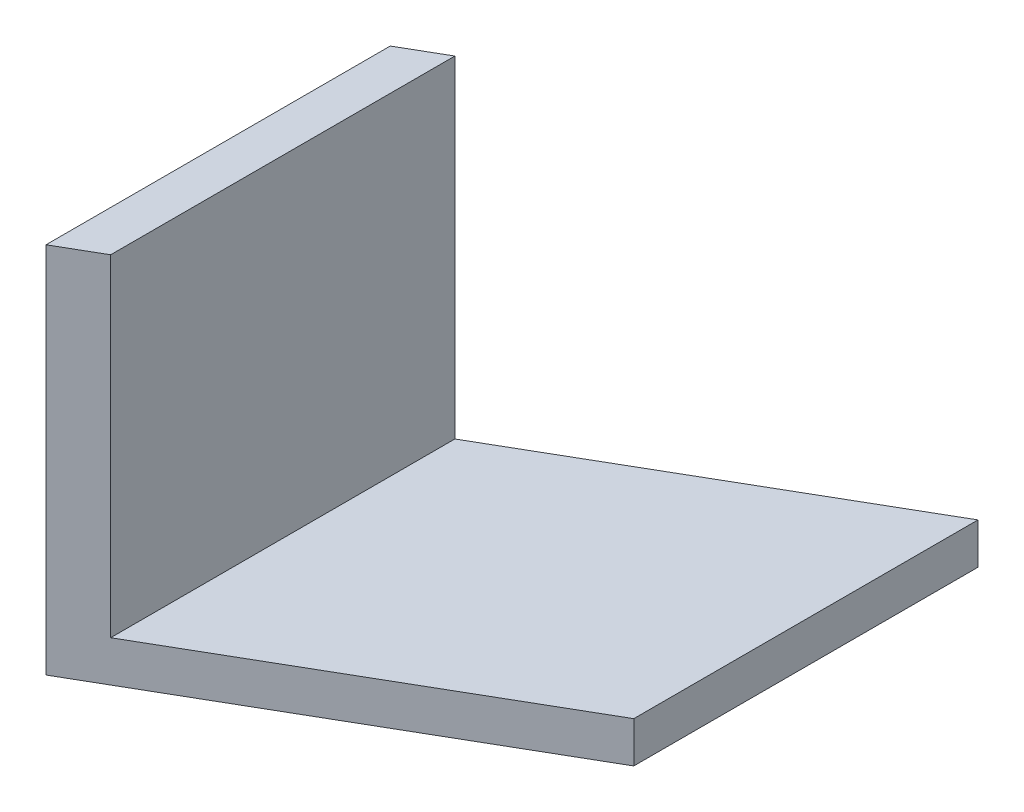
ISO-10303-21;
HEADER;
FILE_DESCRIPTION(('STEP AP214'),'2;1');
FILE_NAME('part.step','',(''),(''),'','','');
FILE_SCHEMA(('AUTOMOTIVE_DESIGN { 1 0 10303 214 1 1 1 1 }'));
ENDSEC;
DATA;
#1=APPLICATION_CONTEXT('core data for automotive mechanical design processes');
#2=APPLICATION_PROTOCOL_DEFINITION('international standard','automotive_design',2000,#1);
#3=PRODUCT_CONTEXT('',#1,'mechanical');
#4=PRODUCT('Part','Part','',(#3));
#5=PRODUCT_RELATED_PRODUCT_CATEGORY('part','',(#4));
#6=PRODUCT_DEFINITION_FORMATION('','',#4);
#7=PRODUCT_DEFINITION_CONTEXT('part definition',#1,'design');
#8=PRODUCT_DEFINITION('design','',#6,#7);
#9=PRODUCT_DEFINITION_SHAPE('','',#8);
#10=(LENGTH_UNIT() NAMED_UNIT(*) SI_UNIT(.MILLI.,.METRE.));
#11=(NAMED_UNIT(*) PLANE_ANGLE_UNIT() SI_UNIT($,.RADIAN.));
#12=(NAMED_UNIT(*) SI_UNIT($,.STERADIAN.) SOLID_ANGLE_UNIT());
#13=UNCERTAINTY_MEASURE_WITH_UNIT(LENGTH_MEASURE(1.E-05),#10,'distance_accuracy_value','');
#14=(GEOMETRIC_REPRESENTATION_CONTEXT(3) GLOBAL_UNCERTAINTY_ASSIGNED_CONTEXT((#13)) GLOBAL_UNIT_ASSIGNED_CONTEXT((#10,
#11,#12)) REPRESENTATION_CONTEXT('',''));
#15=CARTESIAN_POINT('',(0.,0.,0.));
#16=DIRECTION('',(0.,0.,1.));
#17=DIRECTION('',(1.,0.,0.));
#18=AXIS2_PLACEMENT_3D('',#15,#16,#17);
#19=CARTESIAN_POINT('',(25.,-19.5,0.));
#20=DIRECTION('',(0.,-1.,0.));
#21=DIRECTION('',(1.,0.,0.));
#22=AXIS2_PLACEMENT_3D('',#19,#20,#21);
#23=PLANE('',#22);
#24=DIRECTION('',(0.866025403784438,0.,-0.500000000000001));
#25=VECTOR('',#24,1.);
#26=CARTESIAN_POINT('',(25.,-19.5,24.9444650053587));
#27=LINE('',#26,#25);
#28=CARTESIAN_POINT('',(25.,-19.5,24.9444650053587));
#29=VERTEX_POINT('',#28);
#30=CARTESIAN_POINT('',(-19.5,-19.5,50.6365519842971));
#31=VERTEX_POINT('',#30);
#32=EDGE_CURVE('E85',#29,#31,#27,.F.);
#33=ORIENTED_EDGE('',*,*,#32,.T.);
#34=DIRECTION('',(0.,0.,1.));
#35=VECTOR('',#34,1.);
#36=CARTESIAN_POINT('',(-19.5,-19.5,0.));
#37=LINE('',#36,#35);
#38=CARTESIAN_POINT('',(-19.5,-19.5,96.8245735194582));
#39=VERTEX_POINT('',#38);
#40=EDGE_CURVE('E20',#31,#39,#37,.T.);
#41=ORIENTED_EDGE('',*,*,#40,.T.);
#42=DIRECTION('',(-0.866025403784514,0.,0.499999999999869));
#43=VECTOR('',#42,1.);
#44=CARTESIAN_POINT('',(-25.,-19.5,100.));
#45=LINE('',#44,#43);
#46=CARTESIAN_POINT('',(25.,-19.5,71.1324865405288));
#47=VERTEX_POINT('',#46);
#48=EDGE_CURVE('E72',#39,#47,#45,.F.);
#49=ORIENTED_EDGE('',*,*,#48,.T.);
#50=DIRECTION('',(0.,0.,1.));
#51=VECTOR('',#50,1.);
#52=CARTESIAN_POINT('',(25.,-19.5,100.));
#53=LINE('',#52,#51);
#54=EDGE_CURVE('E89',#47,#29,#53,.F.);
#55=ORIENTED_EDGE('',*,*,#54,.T.);
#56=EDGE_LOOP('',(#33,#41,#49,#55));
#57=FACE_BOUND('',#56,.T.);
#58=ADVANCED_FACE('F17',(#57),#23,.F.);
#59=CARTESIAN_POINT('',(-19.5,25.,0.));
#60=DIRECTION('',(-1.,0.,0.));
#61=DIRECTION('',(0.,-1.,0.));
#62=AXIS2_PLACEMENT_3D('',#59,#60,#61);
#63=PLANE('',#62);
#64=DIRECTION('',(0.,1.,0.));
#65=VECTOR('',#64,1.);
#66=CARTESIAN_POINT('',(-19.5,-25.,50.6365519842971));
#67=LINE('',#66,#65);
#68=CARTESIAN_POINT('',(-19.5,25.,50.6365519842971));
#69=VERTEX_POINT('',#68);
#70=EDGE_CURVE('E98',#31,#69,#67,.T.);
#71=ORIENTED_EDGE('',*,*,#70,.T.);
#72=DIRECTION('',(0.,0.,-1.));
#73=VECTOR('',#72,1.);
#74=CARTESIAN_POINT('',(-19.5,25.,100.));
#75=LINE('',#74,#73);
#76=CARTESIAN_POINT('',(-19.5,25.,96.8245735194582));
#77=VERTEX_POINT('',#76);
#78=EDGE_CURVE('E67',#69,#77,#75,.F.);
#79=ORIENTED_EDGE('',*,*,#78,.T.);
#80=DIRECTION('',(0.,1.,0.));
#81=VECTOR('',#80,1.);
#82=CARTESIAN_POINT('',(-19.5,-25.,96.8245735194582));
#83=LINE('',#82,#81);
#84=EDGE_CURVE('E75',#77,#39,#83,.F.);
#85=ORIENTED_EDGE('',*,*,#84,.T.);
#86=ORIENTED_EDGE('',*,*,#40,.F.);
#87=EDGE_LOOP('',(#71,#79,#85,#86));
#88=FACE_BOUND('',#87,.T.);
#89=ADVANCED_FACE('F87',(#88),#63,.F.);
#90=CARTESIAN_POINT('',(-25.,25.,100.));
#91=DIRECTION('',(0.,-1.,0.));
#92=DIRECTION('',(0.,0.,-1.));
#93=AXIS2_PLACEMENT_3D('',#90,#91,#92);
#94=PLANE('',#93);
#95=DIRECTION('',(0.866025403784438,0.,-0.500000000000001));
#96=VECTOR('',#95,1.);
#97=CARTESIAN_POINT('',(25.,25.,24.9444650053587));
#98=LINE('',#97,#96);
#99=CARTESIAN_POINT('',(-25.,25.,53.8119784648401));
#100=VERTEX_POINT('',#99);
#101=EDGE_CURVE('E100',#69,#100,#98,.F.);
#102=ORIENTED_EDGE('',*,*,#101,.T.);
#103=DIRECTION('',(0.,0.,1.));
#104=VECTOR('',#103,1.);
#105=CARTESIAN_POINT('',(-25.,25.,100.));
#106=LINE('',#105,#104);
#107=CARTESIAN_POINT('',(-25.,25.,100.));
#108=VERTEX_POINT('',#107);
#109=EDGE_CURVE('E106',#100,#108,#106,.T.);
#110=ORIENTED_EDGE('',*,*,#109,.T.);
#111=DIRECTION('',(-0.866025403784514,0.,0.499999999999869));
#112=VECTOR('',#111,1.);
#113=CARTESIAN_POINT('',(-25.,25.,100.));
#114=LINE('',#113,#112);
#115=EDGE_CURVE('E81',#108,#77,#114,.F.);
#116=ORIENTED_EDGE('',*,*,#115,.T.);
#117=ORIENTED_EDGE('',*,*,#78,.F.);
#118=EDGE_LOOP('',(#102,#110,#116,#117));
#119=FACE_BOUND('',#118,.T.);
#120=ADVANCED_FACE('F125',(#119),#94,.F.);
#121=CARTESIAN_POINT('',(-25.,-25.,100.));
#122=DIRECTION('',(-0.499999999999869,0.,-0.866025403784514));
#123=DIRECTION('',(-0.866025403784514,0.,0.499999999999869));
#124=AXIS2_PLACEMENT_3D('',#121,#122,#123);
#125=PLANE('',#124);
#126=ORIENTED_EDGE('',*,*,#115,.F.);
#127=DIRECTION('',(0.,1.,0.));
#128=VECTOR('',#127,1.);
#129=CARTESIAN_POINT('',(-25.,25.,100.));
#130=LINE('',#129,#128);
#131=CARTESIAN_POINT('',(-25.,-25.,100.));
#132=VERTEX_POINT('',#131);
#133=EDGE_CURVE('E102',#108,#132,#130,.F.);
#134=ORIENTED_EDGE('',*,*,#133,.T.);
#135=DIRECTION('',(0.866025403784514,0.,-0.49999999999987));
#136=VECTOR('',#135,1.);
#137=CARTESIAN_POINT('',(-25.,-25.,100.));
#138=LINE('',#137,#136);
#139=CARTESIAN_POINT('',(25.,-25.,71.1324865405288));
#140=VERTEX_POINT('',#139);
#141=EDGE_CURVE('E109',#132,#140,#138,.T.);
#142=ORIENTED_EDGE('',*,*,#141,.T.);
#143=DIRECTION('',(0.,1.,0.));
#144=VECTOR('',#143,1.);
#145=CARTESIAN_POINT('',(25.,25.,71.1324865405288));
#146=LINE('',#145,#144);
#147=EDGE_CURVE('E78',#140,#47,#146,.T.);
#148=ORIENTED_EDGE('',*,*,#147,.T.);
#149=ORIENTED_EDGE('',*,*,#48,.F.);
#150=ORIENTED_EDGE('',*,*,#84,.F.);
#151=EDGE_LOOP('',(#126,#134,#142,#148,#149,#150));
#152=FACE_BOUND('',#151,.T.);
#153=ADVANCED_FACE('F74',(#152),#125,.F.);
#154=CARTESIAN_POINT('',(25.,25.,100.));
#155=DIRECTION('',(-1.,0.,0.));
#156=DIRECTION('',(0.,0.,1.));
#157=AXIS2_PLACEMENT_3D('',#154,#155,#156);
#158=PLANE('',#157);
#159=DIRECTION('',(0.,1.,0.));
#160=VECTOR('',#159,1.);
#161=CARTESIAN_POINT('',(25.,-25.,24.9444650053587));
#162=LINE('',#161,#160);
#163=CARTESIAN_POINT('',(25.,-25.,24.9444650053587));
#164=VERTEX_POINT('',#163);
#165=EDGE_CURVE('E94',#164,#29,#162,.T.);
#166=ORIENTED_EDGE('',*,*,#165,.T.);
#167=ORIENTED_EDGE('',*,*,#54,.F.);
#168=ORIENTED_EDGE('',*,*,#147,.F.);
#169=DIRECTION('',(0.,0.,1.));
#170=VECTOR('',#169,1.);
#171=CARTESIAN_POINT('',(25.,-25.,100.));
#172=LINE('',#171,#170);
#173=EDGE_CURVE('E111',#140,#164,#172,.F.);
#174=ORIENTED_EDGE('',*,*,#173,.T.);
#175=EDGE_LOOP('',(#166,#167,#168,#174));
#176=FACE_BOUND('',#175,.T.);
#177=ADVANCED_FACE('F123',(#176),#158,.F.);
#178=CARTESIAN_POINT('',(25.,-25.,24.9444650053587));
#179=DIRECTION('',(0.500000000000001,0.,0.866025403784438));
#180=DIRECTION('',(0.866025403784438,0.,-0.500000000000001));
#181=AXIS2_PLACEMENT_3D('',#178,#179,#180);
#182=PLANE('',#181);
#183=ORIENTED_EDGE('',*,*,#70,.F.);
#184=ORIENTED_EDGE('',*,*,#32,.F.);
#185=ORIENTED_EDGE('',*,*,#165,.F.);
#186=DIRECTION('',(-0.866025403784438,0.,0.500000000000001));
#187=VECTOR('',#186,1.);
#188=CARTESIAN_POINT('',(25.,-25.,24.9444650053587));
#189=LINE('',#188,#187);
#190=CARTESIAN_POINT('',(-25.,-25.,53.8119784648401));
#191=VERTEX_POINT('',#190);
#192=EDGE_CURVE('E26',#164,#191,#189,.T.);
#193=ORIENTED_EDGE('',*,*,#192,.T.);
#194=DIRECTION('',(0.,1.,0.));
#195=VECTOR('',#194,1.);
#196=CARTESIAN_POINT('',(-25.,25.,53.8119784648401));
#197=LINE('',#196,#195);
#198=EDGE_CURVE('E34',#191,#100,#197,.T.);
#199=ORIENTED_EDGE('',*,*,#198,.T.);
#200=ORIENTED_EDGE('',*,*,#101,.F.);
#201=EDGE_LOOP('',(#183,#184,#185,#193,#199,#200));
#202=FACE_BOUND('',#201,.T.);
#203=ADVANCED_FACE('F117',(#202),#182,.F.);
#204=CARTESIAN_POINT('',(-25.,25.,100.));
#205=DIRECTION('',(1.,0.,0.));
#206=DIRECTION('',(0.,1.,0.));
#207=AXIS2_PLACEMENT_3D('',#204,#205,#206);
#208=PLANE('',#207);
#209=ORIENTED_EDGE('',*,*,#198,.F.);
#210=DIRECTION('',(0.,0.,1.));
#211=VECTOR('',#210,1.);
#212=CARTESIAN_POINT('',(-25.,-25.,100.));
#213=LINE('',#212,#211);
#214=EDGE_CURVE('E11',#191,#132,#213,.T.);
#215=ORIENTED_EDGE('',*,*,#214,.T.);
#216=ORIENTED_EDGE('',*,*,#133,.F.);
#217=ORIENTED_EDGE('',*,*,#109,.F.);
#218=EDGE_LOOP('',(#209,#215,#216,#217));
#219=FACE_BOUND('',#218,.T.);
#220=ADVANCED_FACE('F127',(#219),#208,.F.);
#221=CARTESIAN_POINT('',(-25.,-25.,100.));
#222=DIRECTION('',(0.,1.,0.));
#223=DIRECTION('',(0.,0.,1.));
#224=AXIS2_PLACEMENT_3D('',#221,#222,#223);
#225=PLANE('',#224);
#226=ORIENTED_EDGE('',*,*,#192,.F.);
#227=ORIENTED_EDGE('',*,*,#173,.F.);
#228=ORIENTED_EDGE('',*,*,#141,.F.);
#229=ORIENTED_EDGE('',*,*,#214,.F.);
#230=EDGE_LOOP('',(#226,#227,#228,#229));
#231=FACE_BOUND('',#230,.T.);
#232=ADVANCED_FACE('F121',(#231),#225,.F.);
#233=CLOSED_SHELL('',(#58,#89,#120,#153,#177,#203,#220,#232));
#234=MANIFOLD_SOLID_BREP('B1',#233);
#235=ADVANCED_BREP_SHAPE_REPRESENTATION('',(#18,#234),#14);
#236=SHAPE_DEFINITION_REPRESENTATION(#9,#235);
ENDSEC;
END-ISO-10303-21;
